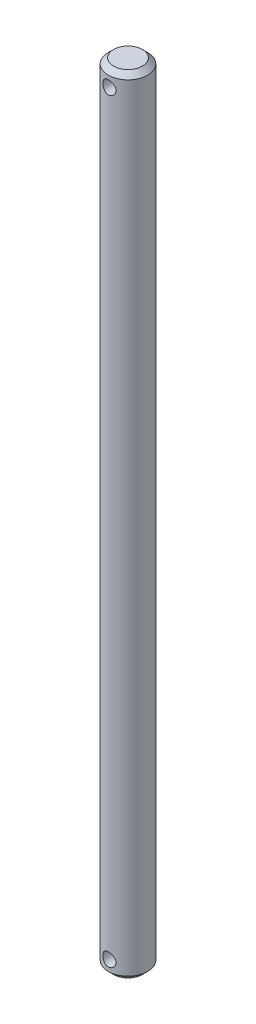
from build123d import *

# Parameters (mm, degrees)
SKETCH1_R          = 4.7625
EXTRUDE1_DEPTH     = 190.5
CHAMFER1_SIZE      = 1.27
SKETCH2_R          = 1.5875
CUT_EXTRUDE1_DEPTH = 191.797424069


with BuildPart() as part:
    # Sketch1 → Extrude1 (new body)
    with BuildSketch(Plane(origin=(0, 0, 0), x_dir=(1, 0, 0), z_dir=(0, 1, 0))):
        with Locations(Location((0, 0, 0), (0, 0, 270))):
            Circle(SKETCH1_R)
    extrude(amount=EXTRUDE1_DEPTH)

    # Chamfer1
    chamfer1_edges = [part.edges().sort_by_distance(p)[0] for p in [
        (0, 0, -4.7625),
        (0, 190.5, -4.7625),
    ]]
    chamfer(chamfer1_edges, length=CHAMFER1_SIZE)

    # Sketch2 → Cut-Extrude1 (cut, through all)
    with BuildSketch(Plane.XY.offset(4.7625)):
        with Locations(Location((0, 3.81, 0), (0, 0, 89.999999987))):
            Circle(SKETCH2_R)
        with Locations(Location((0, 186.69, 0), (0, 0, 89.999999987))):
            Circle(SKETCH2_R)
    extrude(amount=-CUT_EXTRUDE1_DEPTH, mode=Mode.SUBTRACT)


solid = part.part
